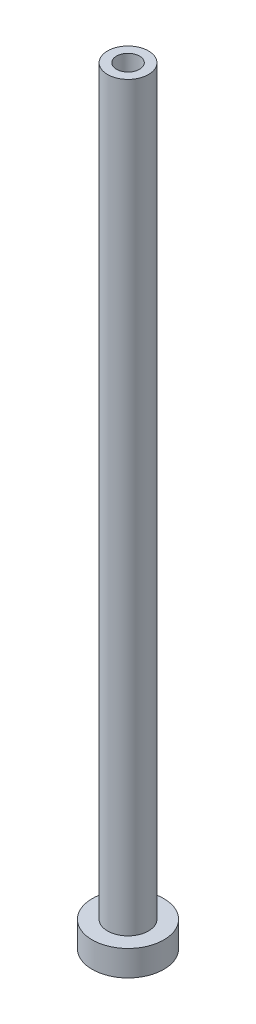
ISO-10303-21;
HEADER;
FILE_DESCRIPTION(('STEP AP214'),'2;1');
FILE_NAME('part.step','',(''),(''),'','','');
FILE_SCHEMA(('AUTOMOTIVE_DESIGN { 1 0 10303 214 1 1 1 1 }'));
ENDSEC;
DATA;
#1=APPLICATION_CONTEXT('core data for automotive mechanical design processes');
#2=APPLICATION_PROTOCOL_DEFINITION('international standard','automotive_design',2000,#1);
#3=PRODUCT_CONTEXT('',#1,'mechanical');
#4=PRODUCT('Part','Part','',(#3));
#5=PRODUCT_RELATED_PRODUCT_CATEGORY('part','',(#4));
#6=PRODUCT_DEFINITION_FORMATION('','',#4);
#7=PRODUCT_DEFINITION_CONTEXT('part definition',#1,'design');
#8=PRODUCT_DEFINITION('design','',#6,#7);
#9=PRODUCT_DEFINITION_SHAPE('','',#8);
#10=(LENGTH_UNIT() NAMED_UNIT(*) SI_UNIT(.MILLI.,.METRE.));
#11=(NAMED_UNIT(*) PLANE_ANGLE_UNIT() SI_UNIT($,.RADIAN.));
#12=(NAMED_UNIT(*) SI_UNIT($,.STERADIAN.) SOLID_ANGLE_UNIT());
#13=UNCERTAINTY_MEASURE_WITH_UNIT(LENGTH_MEASURE(1.E-05),#10,'distance_accuracy_value','');
#14=(GEOMETRIC_REPRESENTATION_CONTEXT(3) GLOBAL_UNCERTAINTY_ASSIGNED_CONTEXT((#13)) GLOBAL_UNIT_ASSIGNED_CONTEXT((#10,
#11,#12)) REPRESENTATION_CONTEXT('',''));
#15=CARTESIAN_POINT('',(0.,0.,0.));
#16=DIRECTION('',(0.,0.,1.));
#17=DIRECTION('',(1.,0.,0.));
#18=AXIS2_PLACEMENT_3D('',#15,#16,#17);
#19=CARTESIAN_POINT('',(0.,0.,0.));
#20=DIRECTION('',(0.,-1.,0.));
#21=DIRECTION('',(0.,0.,-1.));
#22=AXIS2_PLACEMENT_3D('',#19,#20,#21);
#23=CYLINDRICAL_SURFACE('',#22,7.);
#24=CARTESIAN_POINT('',(0.,-5.,0.));
#25=DIRECTION('',(0.,-1.,0.));
#26=DIRECTION('',(0.,0.,-1.));
#27=AXIS2_PLACEMENT_3D('',#24,#25,#26);
#28=CIRCLE('',#27,7.);
#29=CARTESIAN_POINT('',(0.,-5.,-7.));
#30=VERTEX_POINT('',#29);
#31=EDGE_CURVE('E42',#30,#30,#28,.T.);
#32=ORIENTED_EDGE('',*,*,#31,.F.);
#33=EDGE_LOOP('',(#32));
#34=FACE_BOUND('',#33,.T.);
#35=CARTESIAN_POINT('',(0.,0.,0.));
#36=DIRECTION('',(0.,-1.,0.));
#37=DIRECTION('',(0.,0.,-1.));
#38=AXIS2_PLACEMENT_3D('',#35,#36,#37);
#39=CIRCLE('',#38,7.);
#40=CARTESIAN_POINT('',(0.,0.,-7.));
#41=VERTEX_POINT('',#40);
#42=EDGE_CURVE('E9',#41,#41,#39,.T.);
#43=ORIENTED_EDGE('',*,*,#42,.T.);
#44=EDGE_LOOP('',(#43));
#45=FACE_BOUND('',#44,.T.);
#46=ADVANCED_FACE('F14',(#34,#45),#23,.T.);
#47=CARTESIAN_POINT('',(-7.,0.,0.));
#48=DIRECTION('',(0.,-1.,0.));
#49=DIRECTION('',(0.,0.,-1.));
#50=AXIS2_PLACEMENT_3D('',#47,#48,#49);
#51=PLANE('',#50);
#52=ORIENTED_EDGE('',*,*,#42,.F.);
#53=EDGE_LOOP('',(#52));
#54=FACE_BOUND('',#53,.T.);
#55=CARTESIAN_POINT('',(0.,0.,0.));
#56=DIRECTION('',(0.,-1.,0.));
#57=DIRECTION('',(0.,0.,-1.));
#58=AXIS2_PLACEMENT_3D('',#55,#56,#57);
#59=CIRCLE('',#58,4.);
#60=CARTESIAN_POINT('',(0.,0.,-4.));
#61=VERTEX_POINT('',#60);
#62=EDGE_CURVE('E20',#61,#61,#59,.T.);
#63=ORIENTED_EDGE('',*,*,#62,.T.);
#64=EDGE_LOOP('',(#63));
#65=FACE_BOUND('',#64,.T.);
#66=ADVANCED_FACE('F49',(#54,#65),#51,.F.);
#67=CARTESIAN_POINT('',(0.,0.,0.));
#68=DIRECTION('',(0.,-1.,0.));
#69=DIRECTION('',(0.,0.,-1.));
#70=AXIS2_PLACEMENT_3D('',#67,#68,#69);
#71=CYLINDRICAL_SURFACE('',#70,4.);
#72=ORIENTED_EDGE('',*,*,#62,.F.);
#73=EDGE_LOOP('',(#72));
#74=FACE_BOUND('',#73,.T.);
#75=CARTESIAN_POINT('',(0.,145.,0.));
#76=DIRECTION('',(0.,-1.,0.));
#77=DIRECTION('',(0.,0.,-1.));
#78=AXIS2_PLACEMENT_3D('',#75,#76,#77);
#79=CIRCLE('',#78,4.);
#80=CARTESIAN_POINT('',(0.,145.,-4.));
#81=VERTEX_POINT('',#80);
#82=EDGE_CURVE('E24',#81,#81,#79,.T.);
#83=ORIENTED_EDGE('',*,*,#82,.T.);
#84=EDGE_LOOP('',(#83));
#85=FACE_BOUND('',#84,.T.);
#86=ADVANCED_FACE('F55',(#74,#85),#71,.T.);
#87=CARTESIAN_POINT('',(-4.,145.,0.));
#88=DIRECTION('',(0.,-1.,0.));
#89=DIRECTION('',(0.,0.,-1.));
#90=AXIS2_PLACEMENT_3D('',#87,#88,#89);
#91=PLANE('',#90);
#92=ORIENTED_EDGE('',*,*,#82,.F.);
#93=EDGE_LOOP('',(#92));
#94=FACE_BOUND('',#93,.T.);
#95=CARTESIAN_POINT('',(0.,145.,0.));
#96=DIRECTION('',(0.,-1.,0.));
#97=DIRECTION('',(0.,0.,-1.));
#98=AXIS2_PLACEMENT_3D('',#95,#96,#97);
#99=CIRCLE('',#98,2.25);
#100=CARTESIAN_POINT('',(0.,145.,-2.25));
#101=VERTEX_POINT('',#100);
#102=EDGE_CURVE('E28',#101,#101,#99,.T.);
#103=ORIENTED_EDGE('',*,*,#102,.T.);
#104=EDGE_LOOP('',(#103));
#105=FACE_BOUND('',#104,.T.);
#106=ADVANCED_FACE('F61',(#94,#105),#91,.F.);
#107=CARTESIAN_POINT('',(0.,0.,0.));
#108=DIRECTION('',(0.,-1.,0.));
#109=DIRECTION('',(0.,0.,-1.));
#110=AXIS2_PLACEMENT_3D('',#107,#108,#109);
#111=CYLINDRICAL_SURFACE('',#110,2.25);
#112=ORIENTED_EDGE('',*,*,#102,.F.);
#113=EDGE_LOOP('',(#112));
#114=FACE_BOUND('',#113,.T.);
#115=CARTESIAN_POINT('',(0.,100.,0.));
#116=DIRECTION('',(0.,-1.,0.));
#117=DIRECTION('',(0.,0.,-1.));
#118=AXIS2_PLACEMENT_3D('',#115,#116,#117);
#119=CIRCLE('',#118,2.25);
#120=CARTESIAN_POINT('',(0.,100.,-2.25));
#121=VERTEX_POINT('',#120);
#122=EDGE_CURVE('E33',#121,#121,#119,.T.);
#123=ORIENTED_EDGE('',*,*,#122,.T.);
#124=EDGE_LOOP('',(#123));
#125=FACE_BOUND('',#124,.T.);
#126=ADVANCED_FACE('F67',(#114,#125),#111,.F.);
#127=CARTESIAN_POINT('',(0.,99.6,0.));
#128=DIRECTION('',(0.,-1.,0.));
#129=DIRECTION('',(0.,0.,-1.));
#130=AXIS2_PLACEMENT_3D('',#127,#128,#129);
#131=CONICAL_SURFACE('',#130,2.65,0.785398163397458);
#132=ORIENTED_EDGE('',*,*,#122,.F.);
#133=EDGE_LOOP('',(#132));
#134=FACE_BOUND('',#133,.T.);
#135=CARTESIAN_POINT('',(0.,99.6,0.));
#136=DIRECTION('',(0.,-1.,0.));
#137=DIRECTION('',(0.,0.,-1.));
#138=AXIS2_PLACEMENT_3D('',#135,#136,#137);
#139=CIRCLE('',#138,2.65);
#140=CARTESIAN_POINT('',(0.,99.6,-2.65));
#141=VERTEX_POINT('',#140);
#142=EDGE_CURVE('E36',#141,#141,#139,.T.);
#143=ORIENTED_EDGE('',*,*,#142,.T.);
#144=EDGE_LOOP('',(#143));
#145=FACE_BOUND('',#144,.T.);
#146=ADVANCED_FACE('F71',(#134,#145),#131,.F.);
#147=CARTESIAN_POINT('',(0.,0.,0.));
#148=DIRECTION('',(0.,-1.,0.));
#149=DIRECTION('',(0.,0.,-1.));
#150=AXIS2_PLACEMENT_3D('',#147,#148,#149);
#151=CYLINDRICAL_SURFACE('',#150,2.65);
#152=ORIENTED_EDGE('',*,*,#142,.F.);
#153=EDGE_LOOP('',(#152));
#154=FACE_BOUND('',#153,.T.);
#155=CARTESIAN_POINT('',(0.,-5.,0.));
#156=DIRECTION('',(0.,-1.,0.));
#157=DIRECTION('',(0.,0.,-1.));
#158=AXIS2_PLACEMENT_3D('',#155,#156,#157);
#159=CIRCLE('',#158,2.65);
#160=CARTESIAN_POINT('',(0.,-5.,-2.65));
#161=VERTEX_POINT('',#160);
#162=EDGE_CURVE('E39',#161,#161,#159,.T.);
#163=ORIENTED_EDGE('',*,*,#162,.T.);
#164=EDGE_LOOP('',(#163));
#165=FACE_BOUND('',#164,.T.);
#166=ADVANCED_FACE('F75',(#154,#165),#151,.F.);
#167=CARTESIAN_POINT('',(-2.65,-5.,0.));
#168=DIRECTION('',(0.,1.,0.));
#169=DIRECTION('',(0.,0.,1.));
#170=AXIS2_PLACEMENT_3D('',#167,#168,#169);
#171=PLANE('',#170);
#172=ORIENTED_EDGE('',*,*,#162,.F.);
#173=EDGE_LOOP('',(#172));
#174=FACE_BOUND('',#173,.T.);
#175=ORIENTED_EDGE('',*,*,#31,.T.);
#176=EDGE_LOOP('',(#175));
#177=FACE_BOUND('',#176,.T.);
#178=ADVANCED_FACE('F46',(#174,#177),#171,.F.);
#179=CLOSED_SHELL('',(#46,#66,#86,#106,#126,#146,#166,#178));
#180=MANIFOLD_SOLID_BREP('B1',#179);
#181=ADVANCED_BREP_SHAPE_REPRESENTATION('',(#18,#180),#14);
#182=SHAPE_DEFINITION_REPRESENTATION(#9,#181);
ENDSEC;
END-ISO-10303-21;
